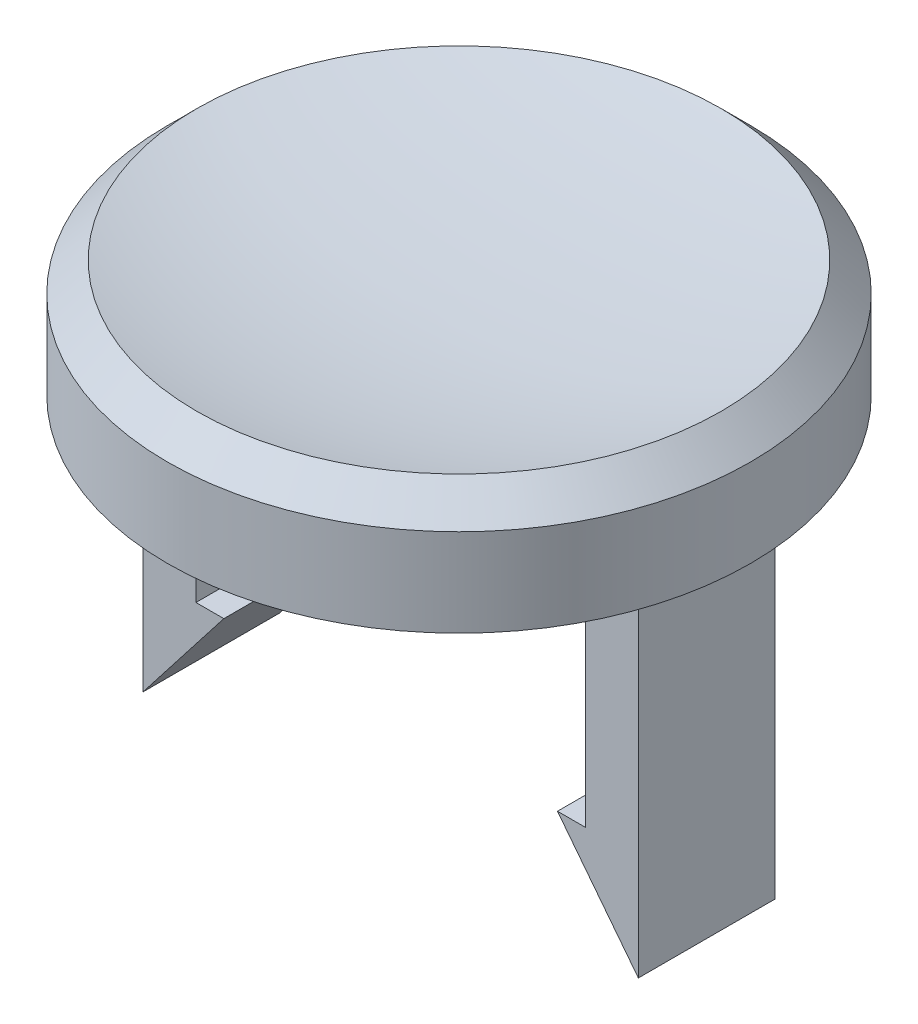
from build123d import *

# Parameters (mm, degrees)
SKETCH1_R           = 10.45
BOSS_EXTRUDE1_DEPTH = 4.2
CHAMFER1_SIZE       = 1.05
SKETCH3_W           = 1.9
SKETCH3_H           = 4.9
BOSS_EXTRUDE2_DEPTH = 8.7
BOSS_EXTRUDE3_DEPTH = 4.9


with BuildPart() as part:
    # Sketch1 → Boss-Extrude1 (new body)
    with BuildSketch(Plane(origin=(0, 0, 0), x_dir=(1, 0, 0), z_dir=(0, 1, 0))):
        with Locations(Location((0, 0, 0), (0, 0, 270))):
            Circle(SKETCH1_R)
    extrude(amount=BOSS_EXTRUDE1_DEPTH)

    # Chamfer1
    chamfer1_edges = [part.edges().sort_by_distance(p)[0] for p in [
        (0, 4.2, -10.45),
    ]]
    chamfer(chamfer1_edges, length=CHAMFER1_SIZE)

    # Sketch2 → Cut-Revolve1 (revolve, cut)
    with BuildSketch(Plane(origin=(0, 0, 0), x_dir=(0, 0, -1), z_dir=(1, 0, 0)), mode=Mode.PRIVATE) as cut_revolve1_sk:
        with BuildLine():
            Line((-9.4, 4.2), (-1.680739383, 4.972450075))
            Line((-1.680739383, 4.972450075), (0, 4.586225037))
            Line((0, 4.586225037), (0, 3.15))
            add(Edge.make_bspline(
                [(-9.4, 4.2), (-5.483755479, 3.172833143), (0, 3.15)],
                knots=[0, 0, 0, 1, 1, 1], degree=2))
        make_face()
    revolve(cut_revolve1_sk.sketch.rotate(Axis((0, 3.15, 0), (0, 1, 0)), 180), axis=Axis((0, 3.15, 0), (0, 1, 0)), mode=Mode.SUBTRACT)

    # Sketch3 → Boss-Extrude2 (add)
    with BuildSketch(Plane.XZ):
        with Locations((-7.93, 0)):
            Rectangle(SKETCH3_W, SKETCH3_H)
    boss_extrude2 = extrude(amount=BOSS_EXTRUDE2_DEPTH)

    # Sketch4 → Boss-Extrude3 (add)
    with BuildSketch(Plane(origin=(0, 0, -2.45), x_dir=(-1, 0, 0), z_dir=(0, 0, -1))):
        Polygon((8.88, -8.7), (6.98, -8.7), (5.98, -8.7), (8.88, -12.427610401), align=None)
    boss_extrude3 = extrude(amount=-BOSS_EXTRUDE3_DEPTH)

    # Mirror1: Boss-Extrude2, Boss-Extrude3 across plane
    add(boss_extrude2.mirror(Plane(origin=(0, 0, 0), x_dir=(0, 0, 1), z_dir=(1, 0, 0))))
    add(boss_extrude3.mirror(Plane(origin=(0, 0, 0), x_dir=(0, 0, 1), z_dir=(1, 0, 0))))


solid = part.part
